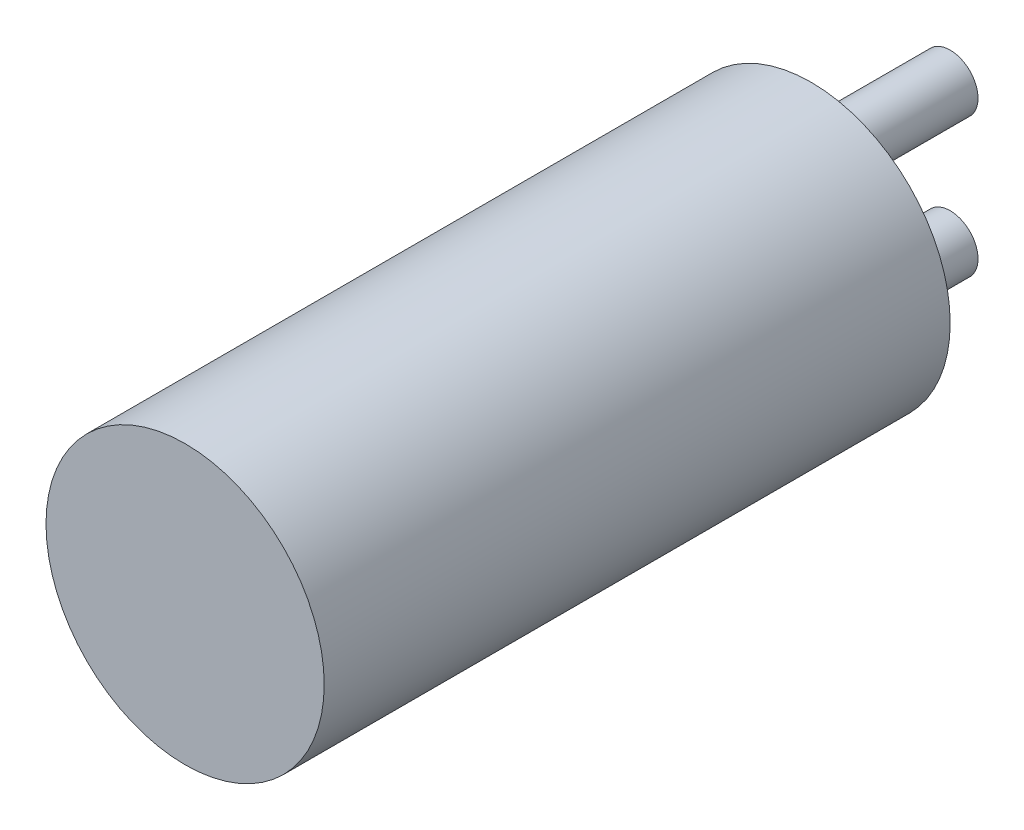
ISO-10303-21;
HEADER;
FILE_DESCRIPTION(('STEP AP214'),'2;1');
FILE_NAME('part.step','',(''),(''),'','','');
FILE_SCHEMA(('AUTOMOTIVE_DESIGN { 1 0 10303 214 1 1 1 1 }'));
ENDSEC;
DATA;
#1=APPLICATION_CONTEXT('core data for automotive mechanical design processes');
#2=APPLICATION_PROTOCOL_DEFINITION('international standard','automotive_design',2000,#1);
#3=PRODUCT_CONTEXT('',#1,'mechanical');
#4=PRODUCT('Part','Part','',(#3));
#5=PRODUCT_RELATED_PRODUCT_CATEGORY('part','',(#4));
#6=PRODUCT_DEFINITION_FORMATION('','',#4);
#7=PRODUCT_DEFINITION_CONTEXT('part definition',#1,'design');
#8=PRODUCT_DEFINITION('design','',#6,#7);
#9=PRODUCT_DEFINITION_SHAPE('','',#8);
#10=(LENGTH_UNIT() NAMED_UNIT(*) SI_UNIT(.MILLI.,.METRE.));
#11=(NAMED_UNIT(*) PLANE_ANGLE_UNIT() SI_UNIT($,.RADIAN.));
#12=(NAMED_UNIT(*) SI_UNIT($,.STERADIAN.) SOLID_ANGLE_UNIT());
#13=UNCERTAINTY_MEASURE_WITH_UNIT(LENGTH_MEASURE(1.E-05),#10,'distance_accuracy_value','');
#14=(GEOMETRIC_REPRESENTATION_CONTEXT(3) GLOBAL_UNCERTAINTY_ASSIGNED_CONTEXT((#13)) GLOBAL_UNIT_ASSIGNED_CONTEXT((#10,
#11,#12)) REPRESENTATION_CONTEXT('',''));
#15=CARTESIAN_POINT('',(0.,0.,0.));
#16=DIRECTION('',(0.,0.,1.));
#17=DIRECTION('',(1.,0.,0.));
#18=AXIS2_PLACEMENT_3D('',#15,#16,#17);
#19=CARTESIAN_POINT('',(0.,0.,0.));
#20=DIRECTION('',(0.,0.,1.));
#21=DIRECTION('',(1.,0.,0.));
#22=AXIS2_PLACEMENT_3D('',#19,#20,#21);
#23=PLANE('',#22);
#24=CARTESIAN_POINT('',(0.,1.27,0.));
#25=DIRECTION('',(0.,0.,1.));
#26=DIRECTION('',(1.,0.,0.));
#27=AXIS2_PLACEMENT_3D('',#24,#25,#26);
#28=CIRCLE('',#27,0.508);
#29=CARTESIAN_POINT('',(0.508,1.27,0.));
#30=VERTEX_POINT('',#29);
#31=EDGE_CURVE('E35',#30,#30,#28,.F.);
#32=ORIENTED_EDGE('',*,*,#31,.F.);
#33=EDGE_LOOP('',(#32));
#34=FACE_BOUND('',#33,.T.);
#35=CARTESIAN_POINT('',(0.,0.,0.));
#36=DIRECTION('',(0.,0.,1.));
#37=DIRECTION('',(1.,0.,0.));
#38=AXIS2_PLACEMENT_3D('',#35,#36,#37);
#39=CIRCLE('',#38,2.54);
#40=CARTESIAN_POINT('',(2.54,0.,0.));
#41=VERTEX_POINT('',#40);
#42=EDGE_CURVE('E43',#41,#41,#39,.T.);
#43=ORIENTED_EDGE('',*,*,#42,.F.);
#44=EDGE_LOOP('',(#43));
#45=FACE_BOUND('',#44,.T.);
#46=CARTESIAN_POINT('',(0.,-1.27,0.));
#47=DIRECTION('',(0.,0.,1.));
#48=DIRECTION('',(1.,0.,0.));
#49=AXIS2_PLACEMENT_3D('',#46,#47,#48);
#50=CIRCLE('',#49,0.508);
#51=CARTESIAN_POINT('',(0.508,-1.27,0.));
#52=VERTEX_POINT('',#51);
#53=EDGE_CURVE('E10',#52,#52,#50,.F.);
#54=ORIENTED_EDGE('',*,*,#53,.F.);
#55=EDGE_LOOP('',(#54));
#56=FACE_BOUND('',#55,.T.);
#57=ADVANCED_FACE('F28',(#34,#45,#56),#23,.F.);
#58=CARTESIAN_POINT('',(0.,0.,11.43));
#59=DIRECTION('',(0.,0.,-1.));
#60=DIRECTION('',(-1.,0.,0.));
#61=AXIS2_PLACEMENT_3D('',#58,#59,#60);
#62=CYLINDRICAL_SURFACE('',#61,2.54);
#63=CARTESIAN_POINT('',(0.,0.,11.43));
#64=DIRECTION('',(0.,0.,1.));
#65=DIRECTION('',(1.,0.,0.));
#66=AXIS2_PLACEMENT_3D('',#63,#64,#65);
#67=CIRCLE('',#66,2.54);
#68=CARTESIAN_POINT('',(2.54,0.,11.43));
#69=VERTEX_POINT('',#68);
#70=EDGE_CURVE('E39',#69,#69,#67,.T.);
#71=ORIENTED_EDGE('',*,*,#70,.F.);
#72=EDGE_LOOP('',(#71));
#73=FACE_BOUND('',#72,.T.);
#74=ORIENTED_EDGE('',*,*,#42,.T.);
#75=EDGE_LOOP('',(#74));
#76=FACE_BOUND('',#75,.T.);
#77=ADVANCED_FACE('F30',(#73,#76),#62,.T.);
#78=CARTESIAN_POINT('',(0.,0.,11.43));
#79=DIRECTION('',(0.,0.,1.));
#80=DIRECTION('',(1.,0.,0.));
#81=AXIS2_PLACEMENT_3D('',#78,#79,#80);
#82=PLANE('',#81);
#83=ORIENTED_EDGE('',*,*,#70,.T.);
#84=EDGE_LOOP('',(#83));
#85=FACE_BOUND('',#84,.T.);
#86=ADVANCED_FACE('F74',(#85),#82,.T.);
#87=CARTESIAN_POINT('',(0.,1.27,-2.54));
#88=DIRECTION('',(0.,0.,1.));
#89=DIRECTION('',(1.,0.,0.));
#90=AXIS2_PLACEMENT_3D('',#87,#88,#89);
#91=CYLINDRICAL_SURFACE('',#90,0.508);
#92=CARTESIAN_POINT('',(0.,1.27,-2.54));
#93=DIRECTION('',(0.,0.,-1.));
#94=DIRECTION('',(-1.,0.,0.));
#95=AXIS2_PLACEMENT_3D('',#92,#93,#94);
#96=CIRCLE('',#95,0.508);
#97=CARTESIAN_POINT('',(-0.508,1.27,-2.54));
#98=VERTEX_POINT('',#97);
#99=EDGE_CURVE('E47',#98,#98,#96,.T.);
#100=ORIENTED_EDGE('',*,*,#99,.F.);
#101=EDGE_LOOP('',(#100));
#102=FACE_BOUND('',#101,.T.);
#103=ORIENTED_EDGE('',*,*,#31,.T.);
#104=EDGE_LOOP('',(#103));
#105=FACE_BOUND('',#104,.T.);
#106=ADVANCED_FACE('F66',(#102,#105),#91,.T.);
#107=CARTESIAN_POINT('',(0.,1.27,-2.54));
#108=DIRECTION('',(0.,0.,-1.));
#109=DIRECTION('',(-1.,0.,0.));
#110=AXIS2_PLACEMENT_3D('',#107,#108,#109);
#111=PLANE('',#110);
#112=ORIENTED_EDGE('',*,*,#99,.T.);
#113=EDGE_LOOP('',(#112));
#114=FACE_BOUND('',#113,.T.);
#115=ADVANCED_FACE('F59',(#114),#111,.T.);
#116=CARTESIAN_POINT('',(0.,-1.27,-2.54));
#117=DIRECTION('',(0.,0.,1.));
#118=DIRECTION('',(1.,0.,0.));
#119=AXIS2_PLACEMENT_3D('',#116,#117,#118);
#120=CYLINDRICAL_SURFACE('',#119,0.508);
#121=CARTESIAN_POINT('',(0.,-1.27,-2.54));
#122=DIRECTION('',(0.,0.,-1.));
#123=DIRECTION('',(-1.,0.,0.));
#124=AXIS2_PLACEMENT_3D('',#121,#122,#123);
#125=CIRCLE('',#124,0.508);
#126=CARTESIAN_POINT('',(-0.508,-1.27,-2.54));
#127=VERTEX_POINT('',#126);
#128=EDGE_CURVE('E51',#127,#127,#125,.T.);
#129=ORIENTED_EDGE('',*,*,#128,.F.);
#130=EDGE_LOOP('',(#129));
#131=FACE_BOUND('',#130,.T.);
#132=ORIENTED_EDGE('',*,*,#53,.T.);
#133=EDGE_LOOP('',(#132));
#134=FACE_BOUND('',#133,.T.);
#135=ADVANCED_FACE('F57',(#131,#134),#120,.T.);
#136=CARTESIAN_POINT('',(0.,-1.27,-2.54));
#137=DIRECTION('',(0.,0.,-1.));
#138=DIRECTION('',(-1.,0.,0.));
#139=AXIS2_PLACEMENT_3D('',#136,#137,#138);
#140=PLANE('',#139);
#141=ORIENTED_EDGE('',*,*,#128,.T.);
#142=EDGE_LOOP('',(#141));
#143=FACE_BOUND('',#142,.T.);
#144=ADVANCED_FACE('F55',(#143),#140,.T.);
#145=CLOSED_SHELL('',(#57,#77,#86,#106,#115,#135,#144));
#146=MANIFOLD_SOLID_BREP('B2',#145);
#147=ADVANCED_BREP_SHAPE_REPRESENTATION('',(#18,#146),#14);
#148=SHAPE_DEFINITION_REPRESENTATION(#9,#147);
ENDSEC;
END-ISO-10303-21;
